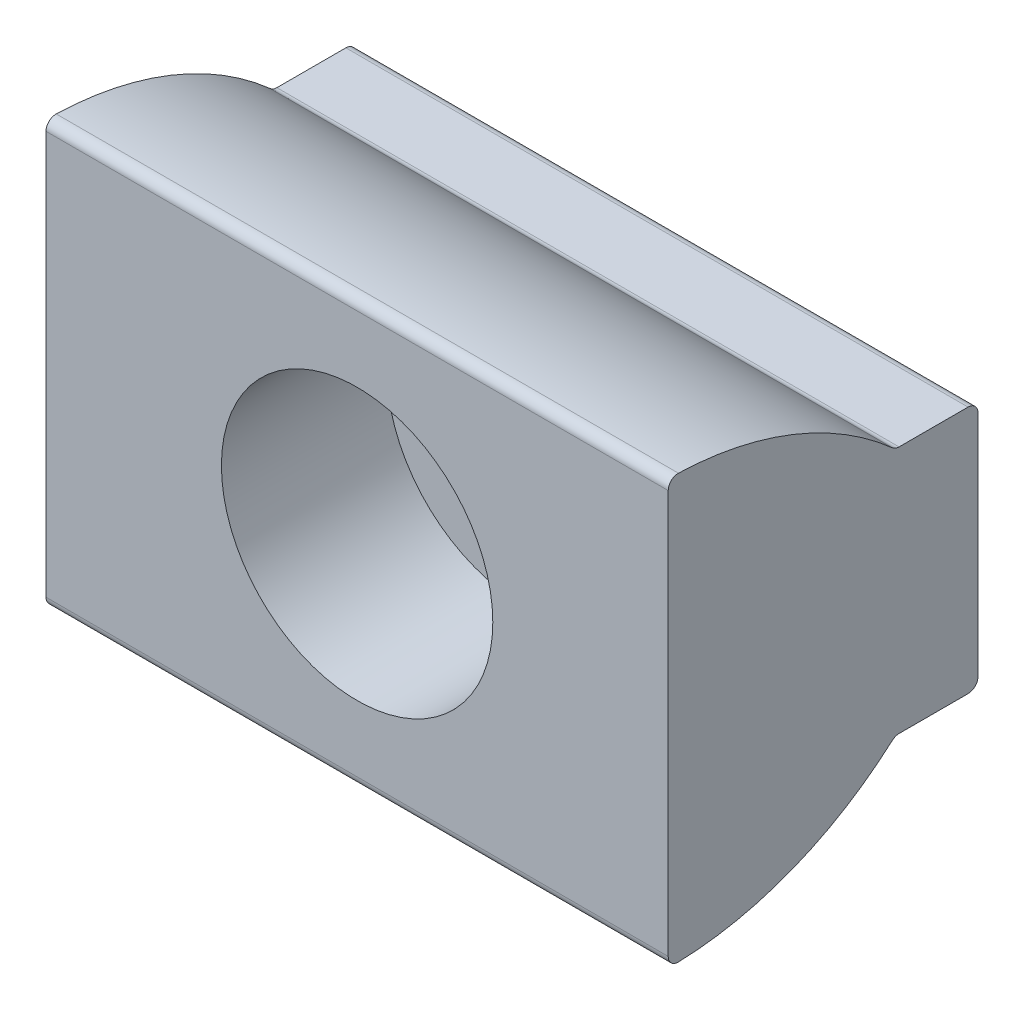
ISO-10303-21;
HEADER;
FILE_DESCRIPTION(('STEP AP214'),'2;1');
FILE_NAME('part.step','',(''),(''),'','','');
FILE_SCHEMA(('AUTOMOTIVE_DESIGN { 1 0 10303 214 1 1 1 1 }'));
ENDSEC;
DATA;
#1=APPLICATION_CONTEXT('core data for automotive mechanical design processes');
#2=APPLICATION_PROTOCOL_DEFINITION('international standard','automotive_design',2000,#1);
#3=PRODUCT_CONTEXT('',#1,'mechanical');
#4=PRODUCT('Part','Part','',(#3));
#5=PRODUCT_RELATED_PRODUCT_CATEGORY('part','',(#4));
#6=PRODUCT_DEFINITION_FORMATION('','',#4);
#7=PRODUCT_DEFINITION_CONTEXT('part definition',#1,'design');
#8=PRODUCT_DEFINITION('design','',#6,#7);
#9=PRODUCT_DEFINITION_SHAPE('','',#8);
#10=(LENGTH_UNIT() NAMED_UNIT(*) SI_UNIT(.MILLI.,.METRE.));
#11=(NAMED_UNIT(*) PLANE_ANGLE_UNIT() SI_UNIT($,.RADIAN.));
#12=(NAMED_UNIT(*) SI_UNIT($,.STERADIAN.) SOLID_ANGLE_UNIT());
#13=UNCERTAINTY_MEASURE_WITH_UNIT(LENGTH_MEASURE(1.E-05),#10,'distance_accuracy_value','');
#14=(GEOMETRIC_REPRESENTATION_CONTEXT(3) GLOBAL_UNCERTAINTY_ASSIGNED_CONTEXT((#13)) GLOBAL_UNIT_ASSIGNED_CONTEXT((#10,
#11,#12)) REPRESENTATION_CONTEXT('',''));
#15=CARTESIAN_POINT('',(0.,0.,0.));
#16=DIRECTION('',(0.,0.,1.));
#17=DIRECTION('',(1.,0.,0.));
#18=AXIS2_PLACEMENT_3D('',#15,#16,#17);
#19=CARTESIAN_POINT('',(11.938,-4.3815,0.));
#20=DIRECTION('',(0.,0.,1.));
#21=DIRECTION('',(1.,0.,0.));
#22=AXIS2_PLACEMENT_3D('',#19,#20,#21);
#23=PLANE('',#22);
#24=DIRECTION('',(0.,1.,0.));
#25=VECTOR('',#24,1.);
#26=CARTESIAN_POINT('',(-11.938,-4.3815,0.));
#27=LINE('',#26,#25);
#28=CARTESIAN_POINT('',(-11.938,-4.3815,0.));
#29=VERTEX_POINT('',#28);
#30=CARTESIAN_POINT('',(-11.938,4.3815,0.));
#31=VERTEX_POINT('',#30);
#32=EDGE_CURVE('E135',#29,#31,#27,.T.);
#33=ORIENTED_EDGE('',*,*,#32,.T.);
#34=DIRECTION('',(-1.,0.,0.));
#35=VECTOR('',#34,1.);
#36=CARTESIAN_POINT('',(11.938,4.3815,0.));
#37=LINE('',#36,#35);
#38=CARTESIAN_POINT('',(11.938,4.3815,0.));
#39=VERTEX_POINT('',#38);
#40=EDGE_CURVE('E186',#39,#31,#37,.T.);
#41=ORIENTED_EDGE('',*,*,#40,.F.);
#42=DIRECTION('',(0.,1.,0.));
#43=VECTOR('',#42,1.);
#44=CARTESIAN_POINT('',(11.938,-4.3815,0.));
#45=LINE('',#44,#43);
#46=CARTESIAN_POINT('',(11.938,-4.3815,0.));
#47=VERTEX_POINT('',#46);
#48=EDGE_CURVE('E158',#47,#39,#45,.T.);
#49=ORIENTED_EDGE('',*,*,#48,.F.);
#50=DIRECTION('',(-1.,0.,0.));
#51=VECTOR('',#50,1.);
#52=CARTESIAN_POINT('',(11.938,-4.3815,0.));
#53=LINE('',#52,#51);
#54=EDGE_CURVE('E189',#47,#29,#53,.T.);
#55=ORIENTED_EDGE('',*,*,#54,.T.);
#56=EDGE_LOOP('',(#33,#41,#49,#55));
#57=FACE_BOUND('',#56,.T.);
#58=CARTESIAN_POINT('',(0.,0.,0.));
#59=DIRECTION('',(0.,0.,1.));
#60=DIRECTION('',(1.,0.,0.));
#61=AXIS2_PLACEMENT_3D('',#58,#59,#60);
#62=CIRCLE('',#61,3.3655);
#63=CARTESIAN_POINT('',(3.3655,0.,0.));
#64=VERTEX_POINT('',#63);
#65=EDGE_CURVE('E18',#64,#64,#62,.F.);
#66=ORIENTED_EDGE('',*,*,#65,.F.);
#67=EDGE_LOOP('',(#66));
#68=FACE_BOUND('',#67,.T.);
#69=ADVANCED_FACE('F14',(#57,#68),#23,.F.);
#70=CARTESIAN_POINT('',(11.938,-7.74122837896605,11.8872));
#71=DIRECTION('',(0.,0.,-1.));
#72=DIRECTION('',(-1.,0.,0.));
#73=AXIS2_PLACEMENT_3D('',#70,#71,#72);
#74=PLANE('',#73);
#75=DIRECTION('',(0.,-1.,0.));
#76=VECTOR('',#75,1.);
#77=CARTESIAN_POINT('',(-11.938,-7.74122837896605,11.8872));
#78=LINE('',#77,#76);
#79=CARTESIAN_POINT('',(-11.938,7.74122837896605,11.8872));
#80=VERTEX_POINT('',#79);
#81=CARTESIAN_POINT('',(-11.938,-7.74122837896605,11.8872));
#82=VERTEX_POINT('',#81);
#83=EDGE_CURVE('E147',#80,#82,#78,.T.);
#84=ORIENTED_EDGE('',*,*,#83,.T.);
#85=DIRECTION('',(-1.,0.,0.));
#86=VECTOR('',#85,1.);
#87=CARTESIAN_POINT('',(11.938,-7.74122837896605,11.8872));
#88=LINE('',#87,#86);
#89=CARTESIAN_POINT('',(11.938,-7.74122837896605,11.8872));
#90=VERTEX_POINT('',#89);
#91=EDGE_CURVE('E122',#90,#82,#88,.T.);
#92=ORIENTED_EDGE('',*,*,#91,.F.);
#93=DIRECTION('',(0.,-1.,0.));
#94=VECTOR('',#93,1.);
#95=CARTESIAN_POINT('',(11.938,-7.74122837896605,11.8872));
#96=LINE('',#95,#94);
#97=CARTESIAN_POINT('',(11.938,7.74122837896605,11.8872));
#98=VERTEX_POINT('',#97);
#99=EDGE_CURVE('E31',#98,#90,#96,.T.);
#100=ORIENTED_EDGE('',*,*,#99,.F.);
#101=DIRECTION('',(-1.,0.,0.));
#102=VECTOR('',#101,1.);
#103=CARTESIAN_POINT('',(11.938,7.74122837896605,11.8872));
#104=LINE('',#103,#102);
#105=EDGE_CURVE('E171',#98,#80,#104,.T.);
#106=ORIENTED_EDGE('',*,*,#105,.T.);
#107=EDGE_LOOP('',(#84,#92,#100,#106));
#108=FACE_BOUND('',#107,.T.);
#109=CARTESIAN_POINT('',(0.,0.,11.8872));
#110=DIRECTION('',(0.,0.,-1.));
#111=DIRECTION('',(-1.,0.,0.));
#112=AXIS2_PLACEMENT_3D('',#109,#110,#111);
#113=CIRCLE('',#112,5.207);
#114=CARTESIAN_POINT('',(-5.207,0.,11.8872));
#115=VERTEX_POINT('',#114);
#116=EDGE_CURVE('E125',#115,#115,#113,.F.);
#117=ORIENTED_EDGE('',*,*,#116,.F.);
#118=EDGE_LOOP('',(#117));
#119=FACE_BOUND('',#118,.T.);
#120=ADVANCED_FACE('F224',(#108,#119),#74,.F.);
#121=CARTESIAN_POINT('',(11.938,-7.74122837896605,11.5062));
#122=DIRECTION('',(-1.,0.,0.));
#123=DIRECTION('',(0.,-1.,0.));
#124=AXIS2_PLACEMENT_3D('',#121,#122,#123);
#125=CYLINDRICAL_SURFACE('',#124,0.381);
#126=CARTESIAN_POINT('',(-11.938,-7.74122837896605,11.5062));
#127=DIRECTION('',(1.,0.,0.));
#128=DIRECTION('',(0.,-1.,0.));
#129=AXIS2_PLACEMENT_3D('',#126,#127,#128);
#130=CIRCLE('',#129,0.381);
#131=CARTESIAN_POINT('',(-11.938,-8.12205355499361,11.4946594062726));
#132=VERTEX_POINT('',#131);
#133=EDGE_CURVE('E109',#82,#132,#130,.T.);
#134=ORIENTED_EDGE('',*,*,#133,.T.);
#135=DIRECTION('',(-1.,0.,0.));
#136=VECTOR('',#135,1.);
#137=CARTESIAN_POINT('',(11.938,-8.12205355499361,11.4946594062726));
#138=LINE('',#137,#136);
#139=CARTESIAN_POINT('',(11.938,-8.12205355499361,11.4946594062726));
#140=VERTEX_POINT('',#139);
#141=EDGE_CURVE('E9',#140,#132,#138,.T.);
#142=ORIENTED_EDGE('',*,*,#141,.F.);
#143=CARTESIAN_POINT('',(11.938,-7.74122837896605,11.5062));
#144=DIRECTION('',(1.,0.,0.));
#145=DIRECTION('',(0.,-1.,0.));
#146=AXIS2_PLACEMENT_3D('',#143,#144,#145);
#147=CIRCLE('',#146,0.381);
#148=EDGE_CURVE('E149',#90,#140,#147,.T.);
#149=ORIENTED_EDGE('',*,*,#148,.F.);
#150=ORIENTED_EDGE('',*,*,#91,.T.);
#151=EDGE_LOOP('',(#134,#142,#149,#150));
#152=FACE_BOUND('',#151,.T.);
#153=ADVANCED_FACE('F16',(#152),#125,.T.);
#154=CARTESIAN_POINT('',(11.938,4.83129566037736,11.8872));
#155=DIRECTION('',(-1.,0.,0.));
#156=DIRECTION('',(0.,-1.,0.));
#157=AXIS2_PLACEMENT_3D('',#154,#155,#156);
#158=CYLINDRICAL_SURFACE('',#157,12.9592956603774);
#159=CARTESIAN_POINT('',(-11.938,4.83129566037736,11.8872));
#160=DIRECTION('',(1.,0.,0.));
#161=DIRECTION('',(0.,1.,0.));
#162=AXIS2_PLACEMENT_3D('',#159,#160,#161);
#163=CIRCLE('',#162,12.9592956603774);
#164=CARTESIAN_POINT('',(-11.938,-4.85861897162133,3.28203303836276));
#165=VERTEX_POINT('',#164);
#166=EDGE_CURVE('E105',#132,#165,#163,.T.);
#167=ORIENTED_EDGE('',*,*,#166,.T.);
#168=DIRECTION('',(-1.,0.,0.));
#169=VECTOR('',#168,1.);
#170=CARTESIAN_POINT('',(11.938,-4.85861897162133,3.28203303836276));
#171=LINE('',#170,#169);
#172=CARTESIAN_POINT('',(11.938,-4.85861897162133,3.28203303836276));
#173=VERTEX_POINT('',#172);
#174=EDGE_CURVE('E23',#173,#165,#171,.T.);
#175=ORIENTED_EDGE('',*,*,#174,.F.);
#176=CARTESIAN_POINT('',(11.938,4.83129566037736,11.8872));
#177=DIRECTION('',(1.,0.,0.));
#178=DIRECTION('',(0.,1.,0.));
#179=AXIS2_PLACEMENT_3D('',#176,#177,#178);
#180=CIRCLE('',#179,12.9592956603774);
#181=EDGE_CURVE('E118',#140,#173,#180,.T.);
#182=ORIENTED_EDGE('',*,*,#181,.F.);
#183=ORIENTED_EDGE('',*,*,#141,.T.);
#184=EDGE_LOOP('',(#167,#175,#182,#183));
#185=FACE_BOUND('',#184,.T.);
#186=ADVANCED_FACE('F117',(#185),#158,.T.);
#187=CARTESIAN_POINT('',(11.938,-5.1435,3.0290433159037));
#188=DIRECTION('',(-1.,0.,0.));
#189=DIRECTION('',(0.,-1.,0.));
#190=AXIS2_PLACEMENT_3D('',#187,#188,#189);
#191=CYLINDRICAL_SURFACE('',#190,0.381);
#192=CARTESIAN_POINT('',(-11.938,-5.1435,3.0290433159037));
#193=DIRECTION('',(-1.,0.,0.));
#194=DIRECTION('',(0.,-1.,0.));
#195=AXIS2_PLACEMENT_3D('',#192,#193,#194);
#196=CIRCLE('',#195,0.381);
#197=CARTESIAN_POINT('',(-11.938,-4.7625,3.0290433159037));
#198=VERTEX_POINT('',#197);
#199=EDGE_CURVE('E111',#165,#198,#196,.T.);
#200=ORIENTED_EDGE('',*,*,#199,.T.);
#201=DIRECTION('',(-1.,0.,0.));
#202=VECTOR('',#201,1.);
#203=CARTESIAN_POINT('',(11.938,-4.7625,3.0290433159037));
#204=LINE('',#203,#202);
#205=CARTESIAN_POINT('',(11.938,-4.7625,3.0290433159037));
#206=VERTEX_POINT('',#205);
#207=EDGE_CURVE('E195',#206,#198,#204,.T.);
#208=ORIENTED_EDGE('',*,*,#207,.F.);
#209=CARTESIAN_POINT('',(11.938,-5.1435,3.0290433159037));
#210=DIRECTION('',(-1.,0.,0.));
#211=DIRECTION('',(0.,-1.,0.));
#212=AXIS2_PLACEMENT_3D('',#209,#210,#211);
#213=CIRCLE('',#212,0.381);
#214=EDGE_CURVE('E152',#173,#206,#213,.T.);
#215=ORIENTED_EDGE('',*,*,#214,.F.);
#216=ORIENTED_EDGE('',*,*,#174,.T.);
#217=EDGE_LOOP('',(#200,#208,#215,#216));
#218=FACE_BOUND('',#217,.T.);
#219=ADVANCED_FACE('F245',(#218),#191,.F.);
#220=CARTESIAN_POINT('',(11.938,-4.7625,0.381));
#221=DIRECTION('',(0.,1.,0.));
#222=DIRECTION('',(-1.,0.,0.));
#223=AXIS2_PLACEMENT_3D('',#220,#221,#222);
#224=PLANE('',#223);
#225=DIRECTION('',(0.,0.,-1.));
#226=VECTOR('',#225,1.);
#227=CARTESIAN_POINT('',(-11.938,-4.7625,0.381));
#228=LINE('',#227,#226);
#229=CARTESIAN_POINT('',(-11.938,-4.7625,0.381));
#230=VERTEX_POINT('',#229);
#231=EDGE_CURVE('E131',#198,#230,#228,.T.);
#232=ORIENTED_EDGE('',*,*,#231,.T.);
#233=DIRECTION('',(-1.,0.,0.));
#234=VECTOR('',#233,1.);
#235=CARTESIAN_POINT('',(11.938,-4.7625,0.381));
#236=LINE('',#235,#234);
#237=CARTESIAN_POINT('',(11.938,-4.7625,0.381));
#238=VERTEX_POINT('',#237);
#239=EDGE_CURVE('E192',#238,#230,#236,.T.);
#240=ORIENTED_EDGE('',*,*,#239,.F.);
#241=DIRECTION('',(0.,0.,-1.));
#242=VECTOR('',#241,1.);
#243=CARTESIAN_POINT('',(11.938,-4.7625,0.381));
#244=LINE('',#243,#242);
#245=EDGE_CURVE('E154',#206,#238,#244,.T.);
#246=ORIENTED_EDGE('',*,*,#245,.F.);
#247=ORIENTED_EDGE('',*,*,#207,.T.);
#248=EDGE_LOOP('',(#232,#240,#246,#247));
#249=FACE_BOUND('',#248,.T.);
#250=ADVANCED_FACE('F241',(#249),#224,.F.);
#251=CARTESIAN_POINT('',(11.938,-4.3815,0.381));
#252=DIRECTION('',(-1.,0.,0.));
#253=DIRECTION('',(0.,-1.,0.));
#254=AXIS2_PLACEMENT_3D('',#251,#252,#253);
#255=CYLINDRICAL_SURFACE('',#254,0.381);
#256=CARTESIAN_POINT('',(-11.938,-4.3815,0.381));
#257=DIRECTION('',(1.,0.,0.));
#258=DIRECTION('',(0.,1.,0.));
#259=AXIS2_PLACEMENT_3D('',#256,#257,#258);
#260=CIRCLE('',#259,0.381);
#261=EDGE_CURVE('E133',#230,#29,#260,.T.);
#262=ORIENTED_EDGE('',*,*,#261,.T.);
#263=ORIENTED_EDGE('',*,*,#54,.F.);
#264=CARTESIAN_POINT('',(11.938,-4.3815,0.381));
#265=DIRECTION('',(1.,0.,0.));
#266=DIRECTION('',(0.,1.,0.));
#267=AXIS2_PLACEMENT_3D('',#264,#265,#266);
#268=CIRCLE('',#267,0.381);
#269=EDGE_CURVE('E156',#238,#47,#268,.T.);
#270=ORIENTED_EDGE('',*,*,#269,.F.);
#271=ORIENTED_EDGE('',*,*,#239,.T.);
#272=EDGE_LOOP('',(#262,#263,#270,#271));
#273=FACE_BOUND('',#272,.T.);
#274=ADVANCED_FACE('F238',(#273),#255,.T.);
#275=CARTESIAN_POINT('',(11.938,4.3815,0.381));
#276=DIRECTION('',(-1.,0.,0.));
#277=DIRECTION('',(0.,-1.,0.));
#278=AXIS2_PLACEMENT_3D('',#275,#276,#277);
#279=CYLINDRICAL_SURFACE('',#278,0.381);
#280=CARTESIAN_POINT('',(-11.938,4.3815,0.381));
#281=DIRECTION('',(1.,0.,0.));
#282=DIRECTION('',(0.,1.,0.));
#283=AXIS2_PLACEMENT_3D('',#280,#281,#282);
#284=CIRCLE('',#283,0.381);
#285=CARTESIAN_POINT('',(-11.938,4.7625,0.381));
#286=VERTEX_POINT('',#285);
#287=EDGE_CURVE('E137',#31,#286,#284,.T.);
#288=ORIENTED_EDGE('',*,*,#287,.T.);
#289=DIRECTION('',(-1.,0.,0.));
#290=VECTOR('',#289,1.);
#291=CARTESIAN_POINT('',(11.938,4.7625,0.381));
#292=LINE('',#291,#290);
#293=CARTESIAN_POINT('',(11.938,4.7625,0.381));
#294=VERTEX_POINT('',#293);
#295=EDGE_CURVE('E183',#294,#286,#292,.T.);
#296=ORIENTED_EDGE('',*,*,#295,.F.);
#297=CARTESIAN_POINT('',(11.938,4.3815,0.381));
#298=DIRECTION('',(1.,0.,0.));
#299=DIRECTION('',(0.,1.,0.));
#300=AXIS2_PLACEMENT_3D('',#297,#298,#299);
#301=CIRCLE('',#300,0.381);
#302=EDGE_CURVE('E160',#39,#294,#301,.T.);
#303=ORIENTED_EDGE('',*,*,#302,.F.);
#304=ORIENTED_EDGE('',*,*,#40,.T.);
#305=EDGE_LOOP('',(#288,#296,#303,#304));
#306=FACE_BOUND('',#305,.T.);
#307=ADVANCED_FACE('F236',(#306),#279,.T.);
#308=CARTESIAN_POINT('',(11.938,4.7625,0.381));
#309=DIRECTION('',(0.,-1.,0.));
#310=DIRECTION('',(1.,0.,0.));
#311=AXIS2_PLACEMENT_3D('',#308,#309,#310);
#312=PLANE('',#311);
#313=DIRECTION('',(0.,0.,1.));
#314=VECTOR('',#313,1.);
#315=CARTESIAN_POINT('',(-11.938,4.7625,0.381));
#316=LINE('',#315,#314);
#317=CARTESIAN_POINT('',(-11.938,4.7625,3.0290433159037));
#318=VERTEX_POINT('',#317);
#319=EDGE_CURVE('E139',#286,#318,#316,.T.);
#320=ORIENTED_EDGE('',*,*,#319,.T.);
#321=DIRECTION('',(-1.,0.,0.));
#322=VECTOR('',#321,1.);
#323=CARTESIAN_POINT('',(11.938,4.7625,3.0290433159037));
#324=LINE('',#323,#322);
#325=CARTESIAN_POINT('',(11.938,4.7625,3.0290433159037));
#326=VERTEX_POINT('',#325);
#327=EDGE_CURVE('E180',#326,#318,#324,.T.);
#328=ORIENTED_EDGE('',*,*,#327,.F.);
#329=DIRECTION('',(0.,0.,1.));
#330=VECTOR('',#329,1.);
#331=CARTESIAN_POINT('',(11.938,4.7625,0.381));
#332=LINE('',#331,#330);
#333=EDGE_CURVE('E162',#294,#326,#332,.T.);
#334=ORIENTED_EDGE('',*,*,#333,.F.);
#335=ORIENTED_EDGE('',*,*,#295,.T.);
#336=EDGE_LOOP('',(#320,#328,#334,#335));
#337=FACE_BOUND('',#336,.T.);
#338=ADVANCED_FACE('F303',(#337),#312,.F.);
#339=CARTESIAN_POINT('',(11.938,5.1435,3.0290433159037));
#340=DIRECTION('',(-1.,0.,0.));
#341=DIRECTION('',(0.,-1.,0.));
#342=AXIS2_PLACEMENT_3D('',#339,#340,#341);
#343=CYLINDRICAL_SURFACE('',#342,0.381);
#344=CARTESIAN_POINT('',(-11.938,5.1435,3.0290433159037));
#345=DIRECTION('',(-1.,0.,0.));
#346=DIRECTION('',(0.,-1.,0.));
#347=AXIS2_PLACEMENT_3D('',#344,#345,#346);
#348=CIRCLE('',#347,0.381);
#349=CARTESIAN_POINT('',(-11.938,4.85861897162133,3.28203303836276));
#350=VERTEX_POINT('',#349);
#351=EDGE_CURVE('E141',#318,#350,#348,.T.);
#352=ORIENTED_EDGE('',*,*,#351,.T.);
#353=DIRECTION('',(-1.,0.,0.));
#354=VECTOR('',#353,1.);
#355=CARTESIAN_POINT('',(11.938,4.85861897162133,3.28203303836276));
#356=LINE('',#355,#354);
#357=CARTESIAN_POINT('',(11.938,4.85861897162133,3.28203303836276));
#358=VERTEX_POINT('',#357);
#359=EDGE_CURVE('E177',#358,#350,#356,.T.);
#360=ORIENTED_EDGE('',*,*,#359,.F.);
#361=CARTESIAN_POINT('',(11.938,5.1435,3.0290433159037));
#362=DIRECTION('',(-1.,0.,0.));
#363=DIRECTION('',(0.,-1.,0.));
#364=AXIS2_PLACEMENT_3D('',#361,#362,#363);
#365=CIRCLE('',#364,0.381);
#366=EDGE_CURVE('E164',#326,#358,#365,.T.);
#367=ORIENTED_EDGE('',*,*,#366,.F.);
#368=ORIENTED_EDGE('',*,*,#327,.T.);
#369=EDGE_LOOP('',(#352,#360,#367,#368));
#370=FACE_BOUND('',#369,.T.);
#371=ADVANCED_FACE('F310',(#370),#343,.F.);
#372=CARTESIAN_POINT('',(11.938,-4.83129566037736,11.8872));
#373=DIRECTION('',(-1.,0.,0.));
#374=DIRECTION('',(0.,-1.,0.));
#375=AXIS2_PLACEMENT_3D('',#372,#373,#374);
#376=CYLINDRICAL_SURFACE('',#375,12.9592956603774);
#377=CARTESIAN_POINT('',(-11.938,-4.83129566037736,11.8872));
#378=DIRECTION('',(1.,0.,0.));
#379=DIRECTION('',(0.,-1.,0.));
#380=AXIS2_PLACEMENT_3D('',#377,#378,#379);
#381=CIRCLE('',#380,12.9592956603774);
#382=CARTESIAN_POINT('',(-11.938,8.12205355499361,11.4946594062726));
#383=VERTEX_POINT('',#382);
#384=EDGE_CURVE('E143',#350,#383,#381,.T.);
#385=ORIENTED_EDGE('',*,*,#384,.T.);
#386=DIRECTION('',(-1.,0.,0.));
#387=VECTOR('',#386,1.);
#388=CARTESIAN_POINT('',(11.938,8.12205355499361,11.4946594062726));
#389=LINE('',#388,#387);
#390=CARTESIAN_POINT('',(11.938,8.12205355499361,11.4946594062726));
#391=VERTEX_POINT('',#390);
#392=EDGE_CURVE('E174',#391,#383,#389,.T.);
#393=ORIENTED_EDGE('',*,*,#392,.F.);
#394=CARTESIAN_POINT('',(11.938,-4.83129566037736,11.8872));
#395=DIRECTION('',(1.,0.,0.));
#396=DIRECTION('',(0.,-1.,0.));
#397=AXIS2_PLACEMENT_3D('',#394,#395,#396);
#398=CIRCLE('',#397,12.9592956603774);
#399=EDGE_CURVE('E166',#358,#391,#398,.T.);
#400=ORIENTED_EDGE('',*,*,#399,.F.);
#401=ORIENTED_EDGE('',*,*,#359,.T.);
#402=EDGE_LOOP('',(#385,#393,#400,#401));
#403=FACE_BOUND('',#402,.T.);
#404=ADVANCED_FACE('F318',(#403),#376,.T.);
#405=CARTESIAN_POINT('',(11.938,7.74122837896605,11.5062));
#406=DIRECTION('',(-1.,0.,0.));
#407=DIRECTION('',(0.,-1.,0.));
#408=AXIS2_PLACEMENT_3D('',#405,#406,#407);
#409=CYLINDRICAL_SURFACE('',#408,0.381);
#410=CARTESIAN_POINT('',(-11.938,7.74122837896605,11.5062));
#411=DIRECTION('',(1.,0.,0.));
#412=DIRECTION('',(0.,-1.,0.));
#413=AXIS2_PLACEMENT_3D('',#410,#411,#412);
#414=CIRCLE('',#413,0.381);
#415=EDGE_CURVE('E145',#383,#80,#414,.T.);
#416=ORIENTED_EDGE('',*,*,#415,.T.);
#417=ORIENTED_EDGE('',*,*,#105,.F.);
#418=CARTESIAN_POINT('',(11.938,7.74122837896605,11.5062));
#419=DIRECTION('',(1.,0.,0.));
#420=DIRECTION('',(0.,-1.,0.));
#421=AXIS2_PLACEMENT_3D('',#418,#419,#420);
#422=CIRCLE('',#421,0.381);
#423=EDGE_CURVE('E36',#391,#98,#422,.T.);
#424=ORIENTED_EDGE('',*,*,#423,.F.);
#425=ORIENTED_EDGE('',*,*,#392,.T.);
#426=EDGE_LOOP('',(#416,#417,#424,#425));
#427=FACE_BOUND('',#426,.T.);
#428=ADVANCED_FACE('F327',(#427),#409,.T.);
#429=CARTESIAN_POINT('',(11.938,-7.74122837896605,11.5062));
#430=DIRECTION('',(-1.,0.,0.));
#431=DIRECTION('',(0.,-1.,0.));
#432=AXIS2_PLACEMENT_3D('',#429,#430,#431);
#433=PLANE('',#432);
#434=ORIENTED_EDGE('',*,*,#148,.T.);
#435=ORIENTED_EDGE('',*,*,#181,.T.);
#436=ORIENTED_EDGE('',*,*,#214,.T.);
#437=ORIENTED_EDGE('',*,*,#245,.T.);
#438=ORIENTED_EDGE('',*,*,#269,.T.);
#439=ORIENTED_EDGE('',*,*,#48,.T.);
#440=ORIENTED_EDGE('',*,*,#302,.T.);
#441=ORIENTED_EDGE('',*,*,#333,.T.);
#442=ORIENTED_EDGE('',*,*,#366,.T.);
#443=ORIENTED_EDGE('',*,*,#399,.T.);
#444=ORIENTED_EDGE('',*,*,#423,.T.);
#445=ORIENTED_EDGE('',*,*,#99,.T.);
#446=EDGE_LOOP('',(#434,#435,#436,#437,#438,#439,#440,#441,#442,#443,#444,#445));
#447=FACE_BOUND('',#446,.T.);
#448=ADVANCED_FACE('F336',(#447),#433,.F.);
#449=CARTESIAN_POINT('',(-11.938,-7.74122837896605,11.5062));
#450=DIRECTION('',(-1.,0.,0.));
#451=DIRECTION('',(0.,-1.,0.));
#452=AXIS2_PLACEMENT_3D('',#449,#450,#451);
#453=PLANE('',#452);
#454=ORIENTED_EDGE('',*,*,#133,.F.);
#455=ORIENTED_EDGE('',*,*,#83,.F.);
#456=ORIENTED_EDGE('',*,*,#415,.F.);
#457=ORIENTED_EDGE('',*,*,#384,.F.);
#458=ORIENTED_EDGE('',*,*,#351,.F.);
#459=ORIENTED_EDGE('',*,*,#319,.F.);
#460=ORIENTED_EDGE('',*,*,#287,.F.);
#461=ORIENTED_EDGE('',*,*,#32,.F.);
#462=ORIENTED_EDGE('',*,*,#261,.F.);
#463=ORIENTED_EDGE('',*,*,#231,.F.);
#464=ORIENTED_EDGE('',*,*,#199,.F.);
#465=ORIENTED_EDGE('',*,*,#166,.F.);
#466=EDGE_LOOP('',(#454,#455,#456,#457,#458,#459,#460,#461,#462,#463,#464,#465));
#467=FACE_BOUND('',#466,.T.);
#468=ADVANCED_FACE('F106',(#467),#453,.T.);
#469=CARTESIAN_POINT('',(0.,0.,25.2235199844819));
#470=DIRECTION('',(0.,0.,1.));
#471=DIRECTION('',(1.,0.,0.));
#472=AXIS2_PLACEMENT_3D('',#469,#470,#471);
#473=CYLINDRICAL_SURFACE('',#472,3.3655);
#474=CARTESIAN_POINT('',(0.,0.,5.5372));
#475=DIRECTION('',(0.,0.,1.));
#476=DIRECTION('',(1.,0.,0.));
#477=AXIS2_PLACEMENT_3D('',#474,#475,#476);
#478=CIRCLE('',#477,3.3655);
#479=CARTESIAN_POINT('',(3.3655,0.,5.5372));
#480=VERTEX_POINT('',#479);
#481=EDGE_CURVE('E202',#480,#480,#478,.T.);
#482=ORIENTED_EDGE('',*,*,#481,.T.);
#483=EDGE_LOOP('',(#482));
#484=FACE_BOUND('',#483,.T.);
#485=ORIENTED_EDGE('',*,*,#65,.T.);
#486=EDGE_LOOP('',(#485));
#487=FACE_BOUND('',#486,.T.);
#488=ADVANCED_FACE('F208',(#484,#487),#473,.F.);
#489=CARTESIAN_POINT('',(0.,0.,25.2235199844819));
#490=DIRECTION('',(0.,0.,1.));
#491=DIRECTION('',(1.,0.,0.));
#492=AXIS2_PLACEMENT_3D('',#489,#490,#491);
#493=CYLINDRICAL_SURFACE('',#492,5.207);
#494=CARTESIAN_POINT('',(0.,0.,5.5372));
#495=DIRECTION('',(0.,0.,1.));
#496=DIRECTION('',(1.,0.,0.));
#497=AXIS2_PLACEMENT_3D('',#494,#495,#496);
#498=CIRCLE('',#497,5.207);
#499=CARTESIAN_POINT('',(5.207,0.,5.5372));
#500=VERTEX_POINT('',#499);
#501=EDGE_CURVE('E127',#500,#500,#498,.T.);
#502=ORIENTED_EDGE('',*,*,#501,.F.);
#503=EDGE_LOOP('',(#502));
#504=FACE_BOUND('',#503,.T.);
#505=ORIENTED_EDGE('',*,*,#116,.T.);
#506=EDGE_LOOP('',(#505));
#507=FACE_BOUND('',#506,.T.);
#508=ADVANCED_FACE('F213',(#504,#507),#493,.F.);
#509=CARTESIAN_POINT('',(0.,3.3655,5.5372));
#510=DIRECTION('',(0.,0.,1.));
#511=DIRECTION('',(1.,0.,0.));
#512=AXIS2_PLACEMENT_3D('',#509,#510,#511);
#513=PLANE('',#512);
#514=ORIENTED_EDGE('',*,*,#501,.T.);
#515=EDGE_LOOP('',(#514));
#516=FACE_BOUND('',#515,.T.);
#517=ORIENTED_EDGE('',*,*,#481,.F.);
#518=EDGE_LOOP('',(#517));
#519=FACE_BOUND('',#518,.T.);
#520=ADVANCED_FACE('F211',(#516,#519),#513,.T.);
#521=CLOSED_SHELL('',(#69,#120,#153,#186,#219,#250,#274,#307,#338,#371,#404,#428,#448,#468,#488,
#508,#520));
#522=MANIFOLD_SOLID_BREP('B1',#521);
#523=ADVANCED_BREP_SHAPE_REPRESENTATION('',(#18,#522),#14);
#524=SHAPE_DEFINITION_REPRESENTATION(#9,#523);
ENDSEC;
END-ISO-10303-21;
